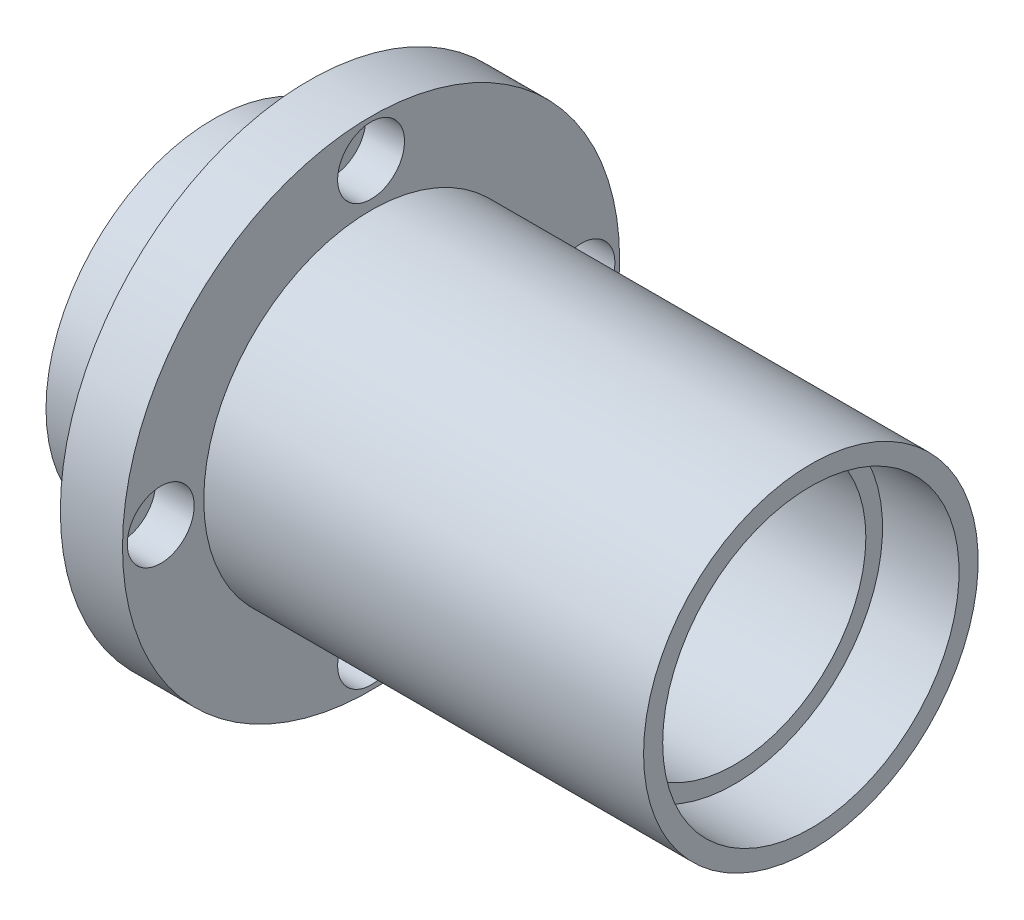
from build123d import *


with BuildPart() as part:
    # Sketch1 → Revolve1 (revolve)
    with BuildSketch(Plane.XY, mode=Mode.PRIVATE) as revolve1_sk:
        Polygon((0, 35), (0, 31), (16, 31), (16, 27.5), (109, 27.5), (109, 31), (125, 31), (125, 35), (33, 35), (33, 52), (20, 52), (20, 35), align=None)
    revolve(revolve1_sk.sketch.rotate(Axis((125, 0, 0), (-1, 0, 0)), 270), axis=Axis((125, 0, 0), (-1, 0, 0)))

    # Sketch2 → Cut-Revolve1 (revolve, cut)
    with BuildSketch(Plane.XY, mode=Mode.PRIVATE) as cut_revolve1_sk:
        Polygon((20, 44), (20, 48.5), (24.9, 48.5), (24.9, 51), (33, 51), (33, 44), align=None)
    revolve(cut_revolve1_sk.sketch.rotate(Axis((33, 44, 0), (-1, 0, 0)), 270), axis=Axis((33, 44, 0), (-1, 0, 0)), mode=Mode.SUBTRACT)

    # Sketch3 → Cut-Revolve2 (revolve, cut)
    with BuildSketch(Plane.XY, mode=Mode.PRIVATE) as cut_revolve2_sk:
        Polygon((20, -44), (20, -39.5), (24.9, -39.5), (24.9, -37), (33, -37), (33, -44), align=None)
    revolve(cut_revolve2_sk.sketch.rotate(Axis((33, -44, 0), (-1, 0, 0)), 270), axis=Axis((33, -44, 0), (-1, 0, 0)), mode=Mode.SUBTRACT)

    # Sketch4 → Cut-Revolve3 (revolve, cut)
    with BuildSketch(Plane.XY.offset(44), mode=Mode.PRIVATE) as cut_revolve3_sk:
        Polygon((20, 0), (20, 4.5), (24.9, 4.5), (24.9, 7), (33, 7), (33, 0), align=None)
    revolve(cut_revolve3_sk.sketch.rotate(Axis((33, 0, 44), (-1, 0, 0)), 270), axis=Axis((33, 0, 44), (-1, 0, 0)), mode=Mode.SUBTRACT)

    # Sketch5 → Cut-Revolve4 (revolve, cut)
    with BuildSketch(Plane.XY.offset(-44), mode=Mode.PRIVATE) as cut_revolve4_sk:
        Polygon((20, 0), (20, 4.5), (24.9, 4.5), (24.9, 7), (33, 7), (33, 0), align=None)
    revolve(cut_revolve4_sk.sketch.rotate(Axis((33, 0, -44), (-1, 0, 0)), 270), axis=Axis((33, 0, -44), (-1, 0, 0)), mode=Mode.SUBTRACT)


solid = part.part
